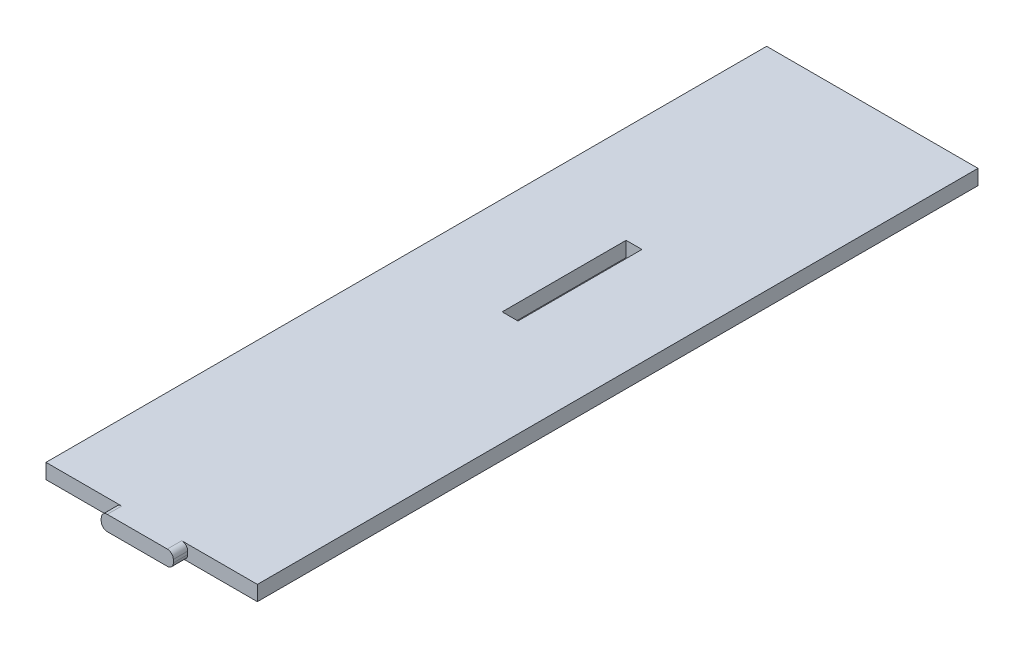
from build123d import *

# Parameters (mm, degrees)
SKETCH1_W           = 176
SKETCH1_H           = 600
SKETCH1_W_2         = 13.2
SKETCH1_H_2         = 103.2
BOSS_EXTRUDE1_DEPTH = 12.5
BOSS_EXTRUDE2_DEPTH = 12


with BuildPart() as part:
    # Sketch1 → Boss-Extrude1 (new body)
    with BuildSketch(Plane(origin=(0, 0, 0), x_dir=(1, 0, 0), z_dir=(0, 1, 0))):
        with Locations((-12.07895549, -50)):
            Rectangle(SKETCH1_W, SKETCH1_H)
        with Locations((-12.07895549, 0)):
            Rectangle(SKETCH1_W_2, SKETCH1_H_2, mode=Mode.SUBTRACT)
    extrude(amount=BOSS_EXTRUDE1_DEPTH)

    # Sketch3 → Boss-Extrude2 (add)
    with BuildSketch(Plane.XY.offset(350)):
        with BuildLine():
            Line((-37.07895549, 12.5), (12.92104451, 12.5))
            ThreePointArc((12.92104451, 12.5), (16.456578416, 11.035533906), (17.92104451, 7.5))
            Line((17.92104451, 7.5), (17.92104451, 5))
            ThreePointArc((17.92104451, 5), (16.456578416, 1.464466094), (12.92104451, 0))
            Line((12.92104451, 0), (-37.07895549, 0))
            ThreePointArc((-37.07895549, 0), (-40.614489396, 1.464466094), (-42.07895549, 5))
            Line((-42.07895549, 5), (-42.07895549, 7.5))
            ThreePointArc((-42.07895549, 7.5), (-40.614489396, 11.035533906), (-37.07895549, 12.5))
        make_face()
    extrude(amount=BOSS_EXTRUDE2_DEPTH)


solid = part.part
